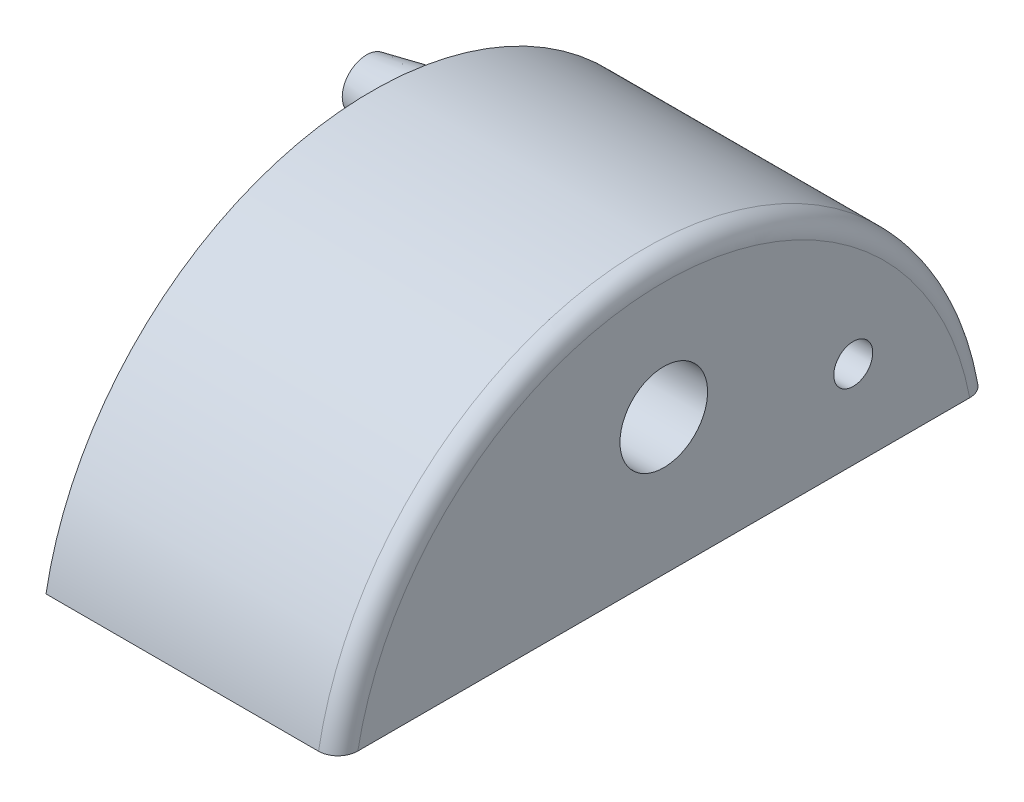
from build123d import *

# Parameters (mm, degrees)
BOSS_EXTRUDE1_DEPTH = 15
SKETCH2_R           = 2.25
CUT_EXTRUDE1_DEPTH  = 29.178005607
FILLET1_R           = 1
SKETCH3_R           = 2.25
BOSS_EXTRUDE2_DEPTH = 10
CHAMFER1_SIZE       = 5
CHAMFER1_SIZE2      = 1
SKETCH4_R           = 1
CUT_EXTRUDE2_DEPTH  = 35.554305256


with BuildPart() as part:
    # Sketch1 → Boss-Extrude1 (new body)
    with BuildSketch(Plane(origin=(0, 0, 0), x_dir=(0, 0, -1), z_dir=(1, 0, 0))):
        with BuildLine():
            Line((-16.733200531, 3), (16.733200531, 3))
            ThreePointArc((16.733200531, 3), (0, 17), (-16.733200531, 3))
        make_face()
    extrude(amount=BOSS_EXTRUDE1_DEPTH)

    # Sketch2 → Cut-Extrude1 (cut, through all)
    with BuildSketch(Plane.ZY):
        with Locations((0, 10)):
            Circle(SKETCH2_R)
    extrude(amount=-CUT_EXTRUDE1_DEPTH, mode=Mode.SUBTRACT)

    # Fillet1
    fillet1_edges = [part.edges().sort_by_distance(p)[0] for p in [
        (15, 17, 0),
    ]]
    fillet(fillet1_edges, radius=FILLET1_R)

    # Sketch3 → Boss-Extrude2 (add)
    with BuildSketch(Plane.ZY):
        with Locations((-9.733200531, 7.5)):
            Circle(SKETCH3_R)
    extrude(amount=BOSS_EXTRUDE2_DEPTH)

    # Chamfer1
    chamfer1_edges = [part.edges().sort_by_distance(p)[0] for p in [
        (-10, 7.5, -11.983200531),
    ]]
    chamfer1_side = [part.faces().sort_by_distance(p)[0] for p in [
        (-5, 7.5, -11.983200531),
    ]]
    chamfer(chamfer1_edges, length=CHAMFER1_SIZE, length2=CHAMFER1_SIZE2, reference=chamfer1_side[0])

    # Sketch4 → Cut-Extrude2 (cut, through all)
    with BuildSketch(Plane.ZY.offset(10)):
        with Locations((-9.733200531, 7.5)):
            Circle(SKETCH4_R)
    extrude(amount=-CUT_EXTRUDE2_DEPTH, mode=Mode.SUBTRACT)


solid = part.part
